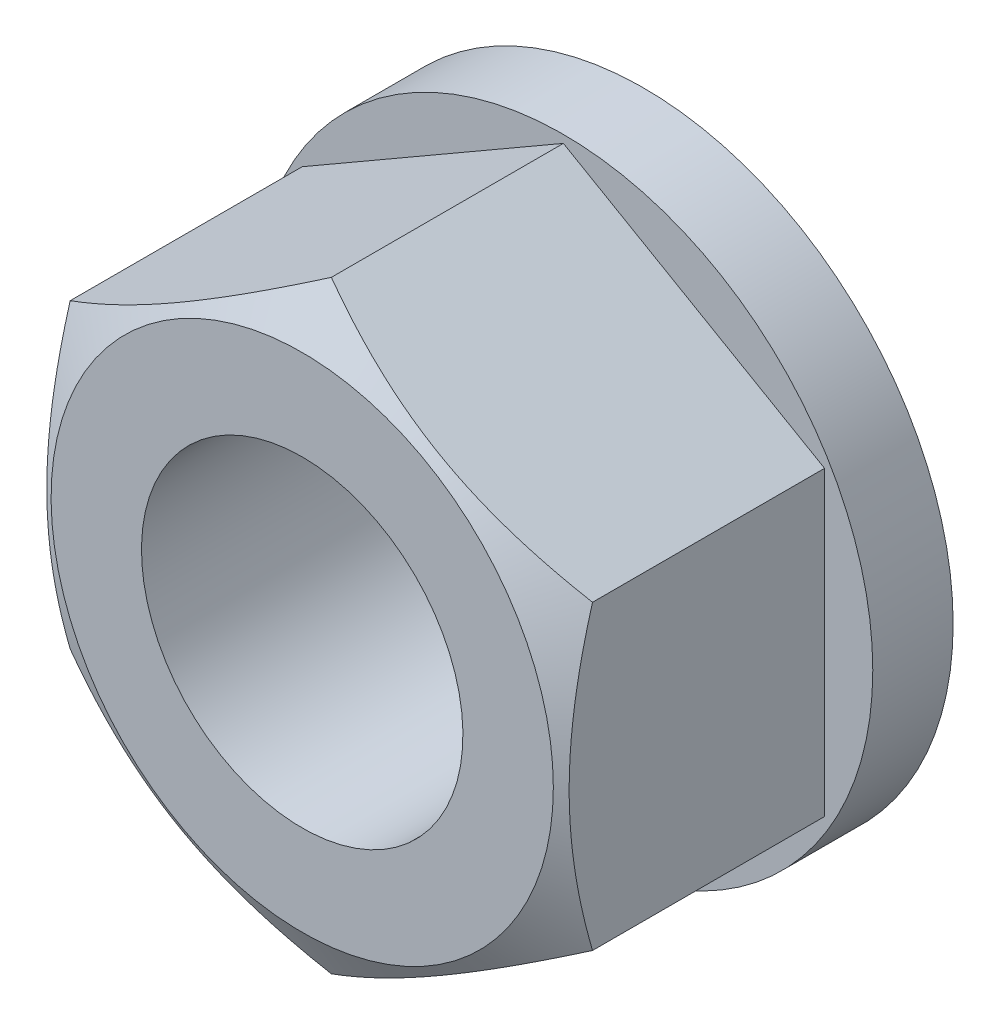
ISO-10303-21;
HEADER;
FILE_DESCRIPTION(('STEP AP214'),'2;1');
FILE_NAME('part.step','',(''),(''),'','','');
FILE_SCHEMA(('AUTOMOTIVE_DESIGN { 1 0 10303 214 1 1 1 1 }'));
ENDSEC;
DATA;
#1=APPLICATION_CONTEXT('core data for automotive mechanical design processes');
#2=APPLICATION_PROTOCOL_DEFINITION('international standard','automotive_design',2000,#1);
#3=PRODUCT_CONTEXT('',#1,'mechanical');
#4=PRODUCT('Part','Part','',(#3));
#5=PRODUCT_RELATED_PRODUCT_CATEGORY('part','',(#4));
#6=PRODUCT_DEFINITION_FORMATION('','',#4);
#7=PRODUCT_DEFINITION_CONTEXT('part definition',#1,'design');
#8=PRODUCT_DEFINITION('design','',#6,#7);
#9=PRODUCT_DEFINITION_SHAPE('','',#8);
#10=(LENGTH_UNIT() NAMED_UNIT(*) SI_UNIT(.MILLI.,.METRE.));
#11=(NAMED_UNIT(*) PLANE_ANGLE_UNIT() SI_UNIT($,.RADIAN.));
#12=(NAMED_UNIT(*) SI_UNIT($,.STERADIAN.) SOLID_ANGLE_UNIT());
#13=UNCERTAINTY_MEASURE_WITH_UNIT(LENGTH_MEASURE(1.E-05),#10,'distance_accuracy_value','');
#14=(GEOMETRIC_REPRESENTATION_CONTEXT(3) GLOBAL_UNCERTAINTY_ASSIGNED_CONTEXT((#13)) GLOBAL_UNIT_ASSIGNED_CONTEXT((#10,
#11,#12)) REPRESENTATION_CONTEXT('',''));
#15=CARTESIAN_POINT('',(0.,0.,0.));
#16=DIRECTION('',(0.,0.,1.));
#17=DIRECTION('',(1.,0.,0.));
#18=AXIS2_PLACEMENT_3D('',#15,#16,#17);
#19=CARTESIAN_POINT('',(6.5,-7.595620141,8.5));
#20=DIRECTION('',(0.,0.,-1.));
#21=DIRECTION('',(-1.,0.,0.));
#22=AXIS2_PLACEMENT_3D('',#19,#20,#21);
#23=PLANE('',#22);
#24=CARTESIAN_POINT('',(0.,0.,8.5));
#25=DIRECTION('',(0.,0.,-1.));
#26=DIRECTION('',(0.,1.,0.));
#27=AXIS2_PLACEMENT_3D('',#24,#25,#26);
#28=CIRCLE('',#27,4.);
#29=CARTESIAN_POINT('',(0.,4.,8.5));
#30=VERTEX_POINT('',#29);
#31=EDGE_CURVE('E86',#30,#30,#28,.T.);
#32=ORIENTED_EDGE('',*,*,#31,.T.);
#33=EDGE_LOOP('',(#32));
#34=FACE_BOUND('',#33,.T.);
#35=CARTESIAN_POINT('',(0.,0.,8.5));
#36=DIRECTION('',(0.,0.,1.));
#37=DIRECTION('',(1.,0.,0.));
#38=AXIS2_PLACEMENT_3D('',#35,#36,#37);
#39=CIRCLE('',#38,6.25);
#40=CARTESIAN_POINT('',(6.25,0.,8.5));
#41=VERTEX_POINT('',#40);
#42=EDGE_CURVE('E219',#41,#41,#39,.T.);
#43=ORIENTED_EDGE('',*,*,#42,.T.);
#44=EDGE_LOOP('',(#43));
#45=FACE_BOUND('',#44,.T.);
#46=ADVANCED_FACE('F14',(#34,#45),#23,.F.);
#47=CARTESIAN_POINT('',(0.,-7.505553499,2.));
#48=DIRECTION('',(0.499999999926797,0.866025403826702,0.));
#49=DIRECTION('',(-0.866025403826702,0.499999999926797,0.));
#50=AXIS2_PLACEMENT_3D('',#47,#48,#49);
#51=PLANE('',#50);
#52=CARTESIAN_POINT('',(-6.5002000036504,-3.75266127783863,7.77503917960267));
#53=CARTESIAN_POINT('',(-6.35732254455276,-3.83515161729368,7.82265800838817));
#54=CARTESIAN_POINT('',(-6.21391236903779,-3.91794952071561,7.86811573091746));
#55=CARTESIAN_POINT('',(-5.92592737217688,-4.08421773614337,7.95411374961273));
#56=CARTESIAN_POINT('',(-5.78135207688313,-4.1676883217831,7.99465192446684));
#57=CARTESIAN_POINT('',(-5.34531135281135,-4.41943655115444,8.10809143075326));
#58=CARTESIAN_POINT('',(-5.05212472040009,-4.58870793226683,8.17261462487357));
#59=CARTESIAN_POINT('',(-4.6133762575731,-4.84201947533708,8.24827584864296));
#60=CARTESIAN_POINT('',(-4.46912536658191,-4.92530276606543,8.26982957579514));
#61=CARTESIAN_POINT('',(-4.17997178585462,-5.09224566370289,8.30597211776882));
#62=CARTESIAN_POINT('',(-4.03506915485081,-5.17590523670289,8.32056154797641));
#63=CARTESIAN_POINT('',(-3.74501222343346,-5.34336968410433,8.34240368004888));
#64=CARTESIAN_POINT('',(-3.59985839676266,-5.42717428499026,8.34966470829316));
#65=CARTESIAN_POINT('',(-3.30942466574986,-5.59485627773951,8.35670213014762));
#66=CARTESIAN_POINT('',(-3.1641447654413,-5.67873366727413,8.35647875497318));
#67=CARTESIAN_POINT('',(-2.76612405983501,-5.90853102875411,8.34557897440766));
#68=CARTESIAN_POINT('',(-2.51351354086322,-6.05437577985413,8.32728061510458));
#69=CARTESIAN_POINT('',(-2.00997032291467,-6.34509659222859,8.26925609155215));
#70=CARTESIAN_POINT('',(-1.75903939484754,-6.48997163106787,8.22951009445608));
#71=CARTESIAN_POINT('',(-1.25448277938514,-6.78127752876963,8.13015652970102));
#72=CARTESIAN_POINT('',(-1.0009207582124,-6.92767162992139,8.07012800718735));
#73=CARTESIAN_POINT('',(-0.497578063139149,-7.21827667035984,7.93388744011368));
#74=CARTESIAN_POINT('',(-0.24779094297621,-7.36249133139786,7.85770739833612));
#75=CARTESIAN_POINT('',(0.000200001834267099,-7.50566897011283,7.77503918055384));
#76=B_SPLINE_CURVE_WITH_KNOTS('',3,(#52,#53,#54,#55,#56,#57,#58,#59,#60,#61,#62,#63,#64,#65,#66,
#67,#68,#69,#70,#71,#72,#73,#74,#75),.UNSPECIFIED.,.F.,.F.,(4,2,2,2,2,2,2,2,2,2,2,4),(0.,
0.515105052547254,1.03043143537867,2.06322554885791,2.56697389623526,3.07067772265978,
3.57380860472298,4.07692394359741,4.95279354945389,5.82947447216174,6.72559912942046,
7.6199645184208),.UNSPECIFIED.);
#77=CARTESIAN_POINT('',(-6.5,-3.75277675,7.77510584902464));
#78=VERTEX_POINT('',#77);
#79=CARTESIAN_POINT('',(0.,-7.505553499,7.77510584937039));
#80=VERTEX_POINT('',#79);
#81=EDGE_CURVE('E100',#78,#80,#76,.T.);
#82=ORIENTED_EDGE('',*,*,#81,.F.);
#83=DIRECTION('',(0.,0.,-1.));
#84=VECTOR('',#83,1.);
#85=CARTESIAN_POINT('',(-6.5,-3.75277675,5.25));
#86=LINE('',#85,#84);
#87=CARTESIAN_POINT('',(-6.5000000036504,-3.75277674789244,2.));
#88=VERTEX_POINT('',#87);
#89=EDGE_CURVE('E70',#78,#88,#86,.T.);
#90=ORIENTED_EDGE('',*,*,#89,.T.);
#91=DIRECTION('',(-0.866025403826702,0.499999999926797,0.));
#92=VECTOR('',#91,1.);
#93=CARTESIAN_POINT('',(0.,-7.505553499,2.));
#94=LINE('',#93,#92);
#95=CARTESIAN_POINT('',(0.,-7.505553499,2.));
#96=VERTEX_POINT('',#95);
#97=EDGE_CURVE('E64',#88,#96,#94,.F.);
#98=ORIENTED_EDGE('',*,*,#97,.T.);
#99=DIRECTION('',(0.,0.,1.));
#100=VECTOR('',#99,1.);
#101=CARTESIAN_POINT('',(0.,-7.505553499,5.25));
#102=LINE('',#101,#100);
#103=EDGE_CURVE('E68',#96,#80,#102,.T.);
#104=ORIENTED_EDGE('',*,*,#103,.T.);
#105=EDGE_LOOP('',(#82,#90,#98,#104));
#106=FACE_BOUND('',#105,.T.);
#107=ADVANCED_FACE('F67',(#106),#51,.F.);
#108=CARTESIAN_POINT('',(6.5,-3.75277675,2.));
#109=DIRECTION('',(-0.499999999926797,0.866025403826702,0.));
#110=DIRECTION('',(-0.866025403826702,-0.499999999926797,0.));
#111=AXIS2_PLACEMENT_3D('',#108,#109,#110);
#112=PLANE('',#111);
#113=CARTESIAN_POINT('',(-0.000199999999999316,-7.50566896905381,7.7750391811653));
#114=CARTESIAN_POINT('',(0.142677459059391,-7.42317862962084,7.82265800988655));
#115=CARTESIAN_POINT('',(0.286087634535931,-7.3403807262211,7.86811573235));
#116=CARTESIAN_POINT('',(0.574072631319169,-7.17411251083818,7.95411375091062));
#117=CARTESIAN_POINT('',(0.718647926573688,-7.09064192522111,7.99465192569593));
#118=CARTESIAN_POINT('',(1.15468865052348,-6.8388936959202,8.10809143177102));
#119=CARTESIAN_POINT('',(1.44787528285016,-6.66962231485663,8.17261462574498));
#120=CARTESIAN_POINT('',(1.88662374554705,-6.4163107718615,8.24827584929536));
#121=CARTESIAN_POINT('',(2.0308746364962,-6.33302748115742,8.26982957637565));
#122=CARTESIAN_POINT('',(2.32002821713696,-6.16608458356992,8.30597211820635));
#123=CARTESIAN_POINT('',(2.46493084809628,-6.0824250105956,8.32056154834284));
#124=CARTESIAN_POINT('',(2.75498777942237,-5.91496056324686,8.34240368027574));
#125=CARTESIAN_POINT('',(2.90014160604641,-5.83115596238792,8.34966470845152));
#126=CARTESIAN_POINT('',(3.19057533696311,-5.66347396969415,8.35670213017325));
#127=CARTESIAN_POINT('',(3.33585523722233,-5.57959658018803,8.35647875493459));
#128=CARTESIAN_POINT('',(3.73387594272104,-5.34979921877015,8.34557897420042));
#129=CARTESIAN_POINT('',(3.98648646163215,-5.20395446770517,8.32728061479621));
#130=CARTESIAN_POINT('',(4.49002967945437,-4.91323365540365,8.26925609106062));
#131=CARTESIAN_POINT('',(4.74096060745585,-4.76835861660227,8.22951009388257));
#132=CARTESIAN_POINT('',(5.24551722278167,-4.47705271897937,8.13015652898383));
#133=CARTESIAN_POINT('',(5.49907924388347,-4.33065861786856,8.07012800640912));
#134=CARTESIAN_POINT('',(6.00242193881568,-4.04005357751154,7.93388743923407));
#135=CARTESIAN_POINT('',(6.25220905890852,-3.89583891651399,7.85770739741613));
#136=CARTESIAN_POINT('',(6.5002000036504,-3.75266127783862,7.77503917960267));
#137=B_SPLINE_CURVE_WITH_KNOTS('',3,(#113,#114,#115,#116,#117,#118,#119,#120,#121,#122,#123,
#124,#125,#126,#127,#128,#129,#130,#131,#132,#133,#134,#135,#136),.UNSPECIFIED.,.F.,.F.,(4,2,2,
2,2,2,2,2,2,2,2,4),(0.,0.515105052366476,1.03043143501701,2.06322554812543,2.56697389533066,
3.07067772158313,3.57380860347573,4.07692394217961,4.95279354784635,5.82947447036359,
6.72559912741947,7.61996451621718),.UNSPECIFIED.);
#138=CARTESIAN_POINT('',(6.5,-3.75277675,7.77510584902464));
#139=VERTEX_POINT('',#138);
#140=EDGE_CURVE('E84',#80,#139,#137,.T.);
#141=ORIENTED_EDGE('',*,*,#140,.F.);
#142=ORIENTED_EDGE('',*,*,#103,.F.);
#143=DIRECTION('',(-0.866025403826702,-0.499999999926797,0.));
#144=VECTOR('',#143,1.);
#145=CARTESIAN_POINT('',(6.5,-3.75277675,2.));
#146=LINE('',#145,#144);
#147=CARTESIAN_POINT('',(6.5000000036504,-3.75277674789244,2.));
#148=VERTEX_POINT('',#147);
#149=EDGE_CURVE('E75',#96,#148,#146,.F.);
#150=ORIENTED_EDGE('',*,*,#149,.T.);
#151=DIRECTION('',(0.,0.,1.));
#152=VECTOR('',#151,1.);
#153=CARTESIAN_POINT('',(6.5,-3.75277675,5.25));
#154=LINE('',#153,#152);
#155=EDGE_CURVE('E85',#148,#139,#154,.T.);
#156=ORIENTED_EDGE('',*,*,#155,.T.);
#157=EDGE_LOOP('',(#141,#142,#150,#156));
#158=FACE_BOUND('',#157,.T.);
#159=ADVANCED_FACE('F80',(#158),#112,.F.);
#160=CARTESIAN_POINT('',(6.5,-3.75277675,2.));
#161=DIRECTION('',(-1.,0.,0.));
#162=DIRECTION('',(0.,0.,1.));
#163=AXIS2_PLACEMENT_3D('',#160,#161,#162);
#164=PLANE('',#163);
#165=CARTESIAN_POINT('',(6.5,-10.0944480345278,5.17667939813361));
#166=CARTESIAN_POINT('',(6.5,-9.81043114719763,5.31450940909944));
#167=CARTESIAN_POINT('',(6.5,-9.5257637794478,5.45102190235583));
#168=CARTESIAN_POINT('',(6.5,-8.95478222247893,5.72067113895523));
#169=CARTESIAN_POINT('',(6.5,-8.66846778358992,5.85380735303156));
#170=CARTESIAN_POINT('',(6.5,-8.09237779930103,6.11663010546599));
#171=CARTESIAN_POINT('',(6.5,-7.80259190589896,6.24629403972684));
#172=CARTESIAN_POINT('',(6.5,-7.22072013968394,6.50033433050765));
#173=CARTESIAN_POINT('',(6.5,-6.92863437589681,6.62471093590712));
#174=CARTESIAN_POINT('',(6.5,-6.33221872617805,6.87069086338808));
#175=CARTESIAN_POINT('',(6.5,-6.02779796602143,6.99207504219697));
#176=CARTESIAN_POINT('',(6.5,-5.41539981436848,7.22569043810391));
#177=CARTESIAN_POINT('',(6.5,-5.10742202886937,7.33792062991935));
#178=CARTESIAN_POINT('',(6.5,-4.4879929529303,7.55029244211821));
#179=CARTESIAN_POINT('',(6.5,-4.17655009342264,7.6504584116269));
#180=CARTESIAN_POINT('',(6.5,-3.54919348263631,7.83549572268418));
#181=CARTESIAN_POINT('',(6.5,-3.2332811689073,7.92037186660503));
#182=CARTESIAN_POINT('',(6.5,-2.59857738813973,8.07031720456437));
#183=CARTESIAN_POINT('',(6.5,-2.27981181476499,8.13549425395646));
#184=CARTESIAN_POINT('',(6.5,-1.63825665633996,8.24235227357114));
#185=CARTESIAN_POINT('',(6.5,-1.31546746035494,8.2840354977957));
#186=CARTESIAN_POINT('',(6.5,-0.831697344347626,8.32617285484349));
#187=CARTESIAN_POINT('',(6.5,-0.671564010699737,8.33681604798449));
#188=CARTESIAN_POINT('',(6.5,-0.350983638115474,8.35132617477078));
#189=CARTESIAN_POINT('',(6.5,-0.190536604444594,8.35519322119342));
#190=CARTESIAN_POINT('',(6.5,0.130375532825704,8.35605127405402));
#191=CARTESIAN_POINT('',(6.5,0.290840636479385,8.35304225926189));
#192=CARTESIAN_POINT('',(6.5,0.611501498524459,8.34022391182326));
#193=CARTESIAN_POINT('',(6.5,0.771697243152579,8.33041424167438));
#194=CARTESIAN_POINT('',(6.5,1.1562660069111,8.29890920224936));
#195=CARTESIAN_POINT('',(6.5,1.3803821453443,8.27401080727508));
#196=CARTESIAN_POINT('',(6.5,1.82694981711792,8.21225787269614));
#197=CARTESIAN_POINT('',(6.5,2.04940112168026,8.1754017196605));
#198=CARTESIAN_POINT('',(6.5,2.71400381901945,8.04885093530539));
#199=CARTESIAN_POINT('',(6.5,3.1531564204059,7.94319694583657));
#200=CARTESIAN_POINT('',(6.5,3.80983188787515,7.75999262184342));
#201=CARTESIAN_POINT('',(6.5,4.03076093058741,7.69394926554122));
#202=CARTESIAN_POINT('',(6.5,4.47047318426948,7.55500512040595));
#203=CARTESIAN_POINT('',(6.5,4.6892563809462,7.48210428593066));
#204=CARTESIAN_POINT('',(6.5,5.12474586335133,7.33061471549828));
#205=CARTESIAN_POINT('',(6.5,5.34145280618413,7.25202785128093));
#206=CARTESIAN_POINT('',(6.5,5.77307124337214,7.09009068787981));
#207=CARTESIAN_POINT('',(6.5,5.98798275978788,7.00674044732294));
#208=CARTESIAN_POINT('',(6.5,6.49928652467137,6.80295702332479));
#209=CARTESIAN_POINT('',(6.5,6.79494350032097,6.68068229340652));
#210=CARTESIAN_POINT('',(6.5,7.3837099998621,6.43012843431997));
#211=CARTESIAN_POINT('',(6.5,7.67681936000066,6.30184892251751));
#212=CARTESIAN_POINT('',(6.5,8.26096561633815,6.04050503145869));
#213=CARTESIAN_POINT('',(6.5,8.55200206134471,5.90743964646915));
#214=CARTESIAN_POINT('',(6.5,9.13230299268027,5.63749273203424));
#215=CARTESIAN_POINT('',(6.5,9.42156743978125,5.50061111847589));
#216=CARTESIAN_POINT('',(6.5,9.99892998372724,5.22360602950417));
#217=CARTESIAN_POINT('',(6.5,10.2870264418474,5.08347914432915));
#218=CARTESIAN_POINT('',(6.5,10.8619710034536,4.80068497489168));
#219=CARTESIAN_POINT('',(6.5,11.1488190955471,4.65801766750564));
#220=CARTESIAN_POINT('',(6.5,12.0077127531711,4.22692717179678));
#221=CARTESIAN_POINT('',(6.5,12.5781883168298,3.93537640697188));
#222=CARTESIAN_POINT('',(6.5,13.667591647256,3.37154002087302));
#223=CARTESIAN_POINT('',(6.5,14.1867673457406,3.09973127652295));
#224=CARTESIAN_POINT('',(6.5,15.2231972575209,2.55243129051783));
#225=CARTESIAN_POINT('',(6.5,15.7404513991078,2.27693991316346));
#226=CARTESIAN_POINT('',(6.5,16.7721419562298,1.72386624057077));
#227=CARTESIAN_POINT('',(6.5,17.2865821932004,1.4462910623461));
#228=CARTESIAN_POINT('',(6.5,18.3142367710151,0.888948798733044));
#229=CARTESIAN_POINT('',(6.5,18.827451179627,0.609181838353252));
#230=CARTESIAN_POINT('',(6.5,19.3402157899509,0.328598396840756));
#231=B_SPLINE_CURVE_WITH_KNOTS('',3,(#165,#166,#167,#168,#169,#170,#171,#172,#173,#174,#175,
#176,#177,#178,#179,#180,#181,#182,#183,#184,#185,#186,#187,#188,#189,#190,#191,#192,#193,#194,
#195,#196,#197,#198,#199,#200,#201,#202,#203,#204,#205,#206,#207,#208,#209,#210,#211,#212,#213,
#214,#215,#216,#217,#218,#219,#220,#221,#222,#223,#224,#225,#226,#227,#228,#229,#230),
.UNSPECIFIED.,.F.,.F.,(4,2,2,2,2,2,2,2,2,2,2,2,2,2,2,2,2,2,2,2,2,2,2,2,2,2,2,2,2,2,2,2,4),(0.,
0.947093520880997,1.89433460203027,2.84670891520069,3.79903834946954,4.78211086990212,
5.76529334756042,6.74645698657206,7.72731191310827,8.70269495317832,9.6779843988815,
10.1593227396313,10.6406530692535,11.1219848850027,11.6033405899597,12.2794438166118,
12.9556383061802,14.3087698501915,15.0004795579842,15.6921938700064,16.383681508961,
17.0751606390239,18.0349025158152,18.9947056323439,19.9547116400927,20.9147388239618,
21.8758250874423,22.836920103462,24.7588414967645,26.516895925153,28.2750153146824,
30.0286546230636,31.7821946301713),.UNSPECIFIED.);
#232=CARTESIAN_POINT('',(6.5,3.75277675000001,7.77510584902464));
#233=VERTEX_POINT('',#232);
#234=EDGE_CURVE('E105',#139,#233,#231,.T.);
#235=ORIENTED_EDGE('',*,*,#234,.F.);
#236=ORIENTED_EDGE('',*,*,#155,.F.);
#237=DIRECTION('',(0.,1.,0.));
#238=VECTOR('',#237,1.);
#239=CARTESIAN_POINT('',(6.5000000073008,0.,2.));
#240=LINE('',#239,#238);
#241=CARTESIAN_POINT('',(6.5000000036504,3.75277674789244,2.));
#242=VERTEX_POINT('',#241);
#243=EDGE_CURVE('E91',#148,#242,#240,.T.);
#244=ORIENTED_EDGE('',*,*,#243,.T.);
#245=DIRECTION('',(0.,0.,1.));
#246=VECTOR('',#245,1.);
#247=CARTESIAN_POINT('',(6.5,3.75277675,5.25));
#248=LINE('',#247,#246);
#249=EDGE_CURVE('E210',#242,#233,#248,.T.);
#250=ORIENTED_EDGE('',*,*,#249,.T.);
#251=EDGE_LOOP('',(#235,#236,#244,#250));
#252=FACE_BOUND('',#251,.T.);
#253=ADVANCED_FACE('F156',(#252),#164,.F.);
#254=CARTESIAN_POINT('',(0.,7.505553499,2.));
#255=DIRECTION('',(-0.499999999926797,-0.866025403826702,0.));
#256=DIRECTION('',(0.866025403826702,-0.499999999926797,0.));
#257=AXIS2_PLACEMENT_3D('',#254,#255,#256);
#258=PLANE('',#257);
#259=CARTESIAN_POINT('',(6.5002000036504,3.75266127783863,7.77503917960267));
#260=CARTESIAN_POINT('',(6.35732254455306,3.83515161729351,7.82265800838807));
#261=CARTESIAN_POINT('',(6.21391236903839,3.91794952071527,7.86811573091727));
#262=CARTESIAN_POINT('',(5.92592737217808,4.08421773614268,7.95411374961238));
#263=CARTESIAN_POINT('',(5.78135207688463,4.16768832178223,7.99465192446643));
#264=CARTESIAN_POINT('',(5.34531135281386,4.41943655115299,8.10809143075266));
#265=CARTESIAN_POINT('',(5.05212472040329,4.58870793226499,8.1726146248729));
#266=CARTESIAN_POINT('',(4.61337625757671,4.842019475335,8.2482758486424));
#267=CARTESIAN_POINT('',(4.46912536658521,4.92530276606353,8.26982957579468));
#268=CARTESIAN_POINT('',(4.1799717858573,5.09224566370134,8.30597211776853));
#269=CARTESIAN_POINT('',(4.03506915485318,5.17590523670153,8.32056154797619));
#270=CARTESIAN_POINT('',(3.74501222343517,5.34336968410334,8.34240368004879));
#271=CARTESIAN_POINT('',(3.59985839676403,5.42717428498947,8.34966470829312));
#272=CARTESIAN_POINT('',(3.30942466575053,5.59485627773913,8.35670213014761));
#273=CARTESIAN_POINT('',(3.16414476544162,5.67873366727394,8.35647875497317));
#274=CARTESIAN_POINT('',(2.76612405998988,5.90853102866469,8.34557897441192));
#275=CARTESIAN_POINT('',(2.51351354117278,6.05437577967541,8.32728061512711));
#276=CARTESIAN_POINT('',(2.00997032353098,6.34509659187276,8.26925609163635));
#277=CARTESIAN_POINT('',(1.75903939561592,6.48997163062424,8.22951009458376));
#278=CARTESIAN_POINT('',(1.25448278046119,6.78127752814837,8.13015652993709));
#279=CARTESIAN_POINT('',(1.0009207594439,6.92767162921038,8.07012800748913));
#280=CARTESIAN_POINT('',(0.497578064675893,7.2182766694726,7.93388744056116));
#281=CARTESIAN_POINT('',(0.247790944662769,7.36249133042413,7.85770739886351));
#282=CARTESIAN_POINT('',(-0.000200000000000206,7.50566896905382,7.77503918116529));
#283=B_SPLINE_CURVE_WITH_KNOTS('',3,(#259,#260,#261,#262,#263,#264,#265,#266,#267,#268,#269,
#270,#271,#272,#273,#274,#275,#276,#277,#278,#279,#280,#281,#282),.UNSPECIFIED.,.F.,.F.,(4,2,2,
2,2,2,2,2,2,2,2,4),(0.,0.515105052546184,1.03043143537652,2.06322554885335,2.56697389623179,
3.0706777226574,3.57380860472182,4.07692394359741,4.9527935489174,5.82947447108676,
6.72559912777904,7.61996451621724),.UNSPECIFIED.);
#284=CARTESIAN_POINT('',(0.,7.505553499,7.77510584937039));
#285=VERTEX_POINT('',#284);
#286=EDGE_CURVE('E144',#233,#285,#283,.T.);
#287=ORIENTED_EDGE('',*,*,#286,.F.);
#288=ORIENTED_EDGE('',*,*,#249,.F.);
#289=DIRECTION('',(0.866025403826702,-0.499999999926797,0.));
#290=VECTOR('',#289,1.);
#291=CARTESIAN_POINT('',(0.,7.505553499,2.));
#292=LINE('',#291,#290);
#293=CARTESIAN_POINT('',(0.,7.505553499,2.));
#294=VERTEX_POINT('',#293);
#295=EDGE_CURVE('E93',#242,#294,#292,.F.);
#296=ORIENTED_EDGE('',*,*,#295,.T.);
#297=DIRECTION('',(0.,0.,1.));
#298=VECTOR('',#297,1.);
#299=CARTESIAN_POINT('',(0.,7.505553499,5.25));
#300=LINE('',#299,#298);
#301=EDGE_CURVE('E119',#294,#285,#300,.T.);
#302=ORIENTED_EDGE('',*,*,#301,.T.);
#303=EDGE_LOOP('',(#287,#288,#296,#302));
#304=FACE_BOUND('',#303,.T.);
#305=ADVANCED_FACE('F159',(#304),#258,.F.);
#306=CARTESIAN_POINT('',(-6.5,3.75277675,2.));
#307=DIRECTION('',(0.499999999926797,-0.866025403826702,0.));
#308=DIRECTION('',(0.866025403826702,0.499999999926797,0.));
#309=AXIS2_PLACEMENT_3D('',#306,#307,#308);
#310=PLANE('',#309);
#311=CARTESIAN_POINT('',(0.000200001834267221,7.50566897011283,7.77503918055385));
#312=CARTESIAN_POINT('',(-0.14267745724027,7.42317863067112,7.8226580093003));
#313=CARTESIAN_POINT('',(-0.28608763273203,7.34038072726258,7.86811573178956));
#314=CARTESIAN_POINT('',(-0.574072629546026,7.1741125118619,7.95411375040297));
#315=CARTESIAN_POINT('',(-0.718647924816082,7.09064192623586,7.99465192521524));
#316=CARTESIAN_POINT('',(-1.15468864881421,6.83889369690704,8.10809143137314));
#317=CARTESIAN_POINT('',(-1.44787528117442,6.66962231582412,8.17261462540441));
#318=CARTESIAN_POINT('',(-1.88662374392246,6.41631077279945,8.24827584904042));
#319=CARTESIAN_POINT('',(-2.03087463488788,6.33302748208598,8.26982957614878));
#320=CARTESIAN_POINT('',(-2.32002821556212,6.16608458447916,8.30597211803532));
#321=CARTESIAN_POINT('',(-2.46493084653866,6.0824250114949,8.32056154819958));
#322=CARTESIAN_POINT('',(-2.75498777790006,5.91496056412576,8.34240368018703));
#323=CARTESIAN_POINT('',(-2.90014160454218,5.83115596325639,8.34966470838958));
#324=CARTESIAN_POINT('',(-3.19057533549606,5.66347397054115,8.35670213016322));
#325=CARTESIAN_POINT('',(-3.33585523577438,5.579596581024,8.35647875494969));
#326=CARTESIAN_POINT('',(-3.73387594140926,5.34979921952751,8.34557897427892));
#327=CARTESIAN_POINT('',(-3.98648646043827,5.20395446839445,8.32728061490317));
#328=CARTESIAN_POINT('',(-4.49002967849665,4.91323365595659,8.2692560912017));
#329=CARTESIAN_POINT('',(-4.74096060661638,4.76835861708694,8.22951009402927));
#330=CARTESIAN_POINT('',(-5.24551722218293,4.47705271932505,8.13015652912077));
#331=CARTESIAN_POINT('',(-5.49907924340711,4.33065861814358,8.07012800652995));
#332=CARTESIAN_POINT('',(-6.00242193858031,4.04005357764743,7.93388743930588));
#333=CARTESIAN_POINT('',(-6.25220905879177,3.8958389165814,7.8577073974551));
#334=CARTESIAN_POINT('',(-6.5002000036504,3.75266127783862,7.77503917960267));
#335=B_SPLINE_CURVE_WITH_KNOTS('',3,(#311,#312,#313,#314,#315,#316,#317,#318,#319,#320,#321,
#322,#323,#324,#325,#326,#327,#328,#329,#330,#331,#332,#333,#334),.UNSPECIFIED.,.F.,.F.,(4,2,2,
2,2,2,2,2,2,2,2,4),(0.,0.515105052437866,1.03043143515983,2.06322554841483,2.56697389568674,
3.07067772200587,3.57380860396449,4.07692394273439,4.95279354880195,5.82947447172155,
6.7255991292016,7.61996451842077),.UNSPECIFIED.);
#336=CARTESIAN_POINT('',(-6.5,3.75277675,7.77510584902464));
#337=VERTEX_POINT('',#336);
#338=EDGE_CURVE('E34',#285,#337,#335,.T.);
#339=ORIENTED_EDGE('',*,*,#338,.F.);
#340=ORIENTED_EDGE('',*,*,#301,.F.);
#341=DIRECTION('',(0.866025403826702,0.499999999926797,0.));
#342=VECTOR('',#341,1.);
#343=CARTESIAN_POINT('',(-6.5,3.75277675,2.));
#344=LINE('',#343,#342);
#345=CARTESIAN_POINT('',(-6.5000000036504,3.75277674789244,2.));
#346=VERTEX_POINT('',#345);
#347=EDGE_CURVE('E43',#294,#346,#344,.F.);
#348=ORIENTED_EDGE('',*,*,#347,.T.);
#349=DIRECTION('',(0.,0.,1.));
#350=VECTOR('',#349,1.);
#351=CARTESIAN_POINT('',(-6.5,3.75277675,5.25));
#352=LINE('',#351,#350);
#353=EDGE_CURVE('E211',#346,#337,#352,.T.);
#354=ORIENTED_EDGE('',*,*,#353,.T.);
#355=EDGE_LOOP('',(#339,#340,#348,#354));
#356=FACE_BOUND('',#355,.T.);
#357=ADVANCED_FACE('F164',(#356),#310,.F.);
#358=CARTESIAN_POINT('',(-6.5,-3.75277675,8.5));
#359=DIRECTION('',(1.,0.,0.));
#360=DIRECTION('',(0.,0.,-1.));
#361=AXIS2_PLACEMENT_3D('',#358,#359,#360);
#362=PLANE('',#361);
#363=CARTESIAN_POINT('',(-6.5,-10.0944480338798,5.17667939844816));
#364=CARTESIAN_POINT('',(-6.5,-9.81043114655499,5.31450940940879));
#365=CARTESIAN_POINT('',(-6.5,-9.52576377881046,5.45102190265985));
#366=CARTESIAN_POINT('',(-6.5,-8.95478222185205,5.7206711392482));
#367=CARTESIAN_POINT('',(-6.5,-8.6684677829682,5.85380735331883));
#368=CARTESIAN_POINT('',(-6.5,-8.09237779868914,6.1166301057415));
#369=CARTESIAN_POINT('',(-6.5,-7.80259190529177,6.2462940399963));
#370=CARTESIAN_POINT('',(-6.5,-7.22072013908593,6.50033433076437));
#371=CARTESIAN_POINT('',(-6.5,-6.92863437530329,6.62471093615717));
#372=CARTESIAN_POINT('',(-6.5,-6.33221872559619,6.87069086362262));
#373=CARTESIAN_POINT('',(-6.5,-6.02779796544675,6.99207504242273));
#374=CARTESIAN_POINT('',(-6.5,-5.41539981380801,7.22569043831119));
#375=CARTESIAN_POINT('',(-6.5,-5.10742202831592,7.33792063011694));
#376=CARTESIAN_POINT('',(-6.5,-4.48799295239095,7.5502924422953));
#377=CARTESIAN_POINT('',(-6.5,-4.17655009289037,7.65045841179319));
#378=CARTESIAN_POINT('',(-6.5,-3.5491934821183,7.83549572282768));
#379=CARTESIAN_POINT('',(-6.5,-3.23328116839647,7.92037186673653));
#380=CARTESIAN_POINT('',(-6.5,-2.59857738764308,8.07031720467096));
#381=CARTESIAN_POINT('',(-6.5,-2.27981181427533,8.1354942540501));
#382=CARTESIAN_POINT('',(-6.5,-1.63825665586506,8.2423522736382));
#383=CARTESIAN_POINT('',(-6.5,-1.31546745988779,8.28403549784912));
#384=CARTESIAN_POINT('',(-6.5,-0.831697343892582,8.32617285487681));
#385=CARTESIAN_POINT('',(-6.5,-0.67156401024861,8.33681604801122));
#386=CARTESIAN_POINT('',(-6.5,-0.350983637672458,8.35132617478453));
#387=CARTESIAN_POINT('',(-6.5,-0.190536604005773,8.35519322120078));
#388=CARTESIAN_POINT('',(-6.5,0.130375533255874,8.35605127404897));
#389=CARTESIAN_POINT('',(-6.5,0.290840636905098,8.35304225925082));
#390=CARTESIAN_POINT('',(-6.5,0.611501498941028,8.34022391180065));
#391=CARTESIAN_POINT('',(-6.5,0.77169724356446,8.33041424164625));
#392=CARTESIAN_POINT('',(-6.5,1.15626600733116,8.29890920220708));
#393=CARTESIAN_POINT('',(-6.5,1.38038214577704,8.27401080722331));
#394=CARTESIAN_POINT('',(-6.5,1.8269498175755,8.21225787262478));
#395=CARTESIAN_POINT('',(-6.5,2.04940112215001,8.17540171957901));
#396=CARTESIAN_POINT('',(-6.5,2.71400381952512,8.04885093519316));
#397=CARTESIAN_POINT('',(-6.5,3.15315642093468,7.94319694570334));
#398=CARTESIAN_POINT('',(-6.5,3.80983188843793,7.7599926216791));
#399=CARTESIAN_POINT('',(-6.5,4.0307609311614,7.69394926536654));
#400=CARTESIAN_POINT('',(-6.5,4.47047318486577,7.55500512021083));
#401=CARTESIAN_POINT('',(-6.5,4.68925638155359,7.48210428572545));
#402=CARTESIAN_POINT('',(-6.5,5.1247458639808,7.33061471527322));
#403=CARTESIAN_POINT('',(-6.5,5.3414528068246,7.25202785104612));
#404=CARTESIAN_POINT('',(-6.5,5.77307124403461,7.09009068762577));
#405=CARTESIAN_POINT('',(-6.5,5.98798276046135,7.00674044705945));
#406=CARTESIAN_POINT('',(-6.5,6.49928652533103,6.80295702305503));
#407=CARTESIAN_POINT('',(-6.5,6.79494350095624,6.68068229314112));
#408=CARTESIAN_POINT('',(-6.5,7.38371000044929,6.43012843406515));
#409=CARTESIAN_POINT('',(-6.5,7.67681936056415,6.30184892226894));
#410=CARTESIAN_POINT('',(-6.5,8.26096561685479,6.04050503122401));
#411=CARTESIAN_POINT('',(-6.5,8.55200206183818,5.90743964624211));
#412=CARTESIAN_POINT('',(-6.5,9.13230299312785,5.63749273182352));
#413=CARTESIAN_POINT('',(-6.5,9.4215674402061,5.50061111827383));
#414=CARTESIAN_POINT('',(-6.5,9.99892998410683,5.22360602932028));
#415=CARTESIAN_POINT('',(-6.5,10.2870264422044,5.08347914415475));
#416=CARTESIAN_POINT('',(-6.5,10.8619710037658,4.80068497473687));
#417=CARTESIAN_POINT('',(-6.5,11.1488190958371,4.65801766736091));
#418=CARTESIAN_POINT('',(-6.5,12.0077127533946,4.22692717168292));
#419=CARTESIAN_POINT('',(-6.5,12.5781883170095,3.93537640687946));
#420=CARTESIAN_POINT('',(-6.5,13.6675916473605,3.37154002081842));
#421=CARTESIAN_POINT('',(-6.5,14.1867673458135,3.09973127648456));
#422=CARTESIAN_POINT('',(-6.5,15.223197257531,2.55243129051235));
#423=CARTESIAN_POINT('',(-6.5,15.7404513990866,2.27693991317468));
#424=CARTESIAN_POINT('',(-6.5,16.7721419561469,1.72386624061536));
#425=CARTESIAN_POINT('',(-6.5,17.286582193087,1.44629106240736));
#426=CARTESIAN_POINT('',(-6.5,18.3142367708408,0.888948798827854));
#427=CARTESIAN_POINT('',(-6.5,18.8274511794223,0.609181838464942));
#428=CARTESIAN_POINT('',(-6.5,19.3402157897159,0.328598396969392));
#429=B_SPLINE_CURVE_WITH_KNOTS('',3,(#363,#364,#365,#366,#367,#368,#369,#370,#371,#372,#373,
#374,#375,#376,#377,#378,#379,#380,#381,#382,#383,#384,#385,#386,#387,#388,#389,#390,#391,#392,
#393,#394,#395,#396,#397,#398,#399,#400,#401,#402,#403,#404,#405,#406,#407,#408,#409,#410,#411,
#412,#413,#414,#415,#416,#417,#418,#419,#420,#421,#422,#423,#424,#425,#426,#427,#428),
.UNSPECIFIED.,.F.,.F.,(4,2,2,2,2,2,2,2,2,2,2,2,2,2,2,2,2,2,2,2,2,2,2,2,2,2,2,2,2,2,2,2,4),(0.,
0.947093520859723,1.89433460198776,2.8467089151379,3.79903834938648,4.78211086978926,
5.76529334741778,6.74645698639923,7.72731191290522,8.70269495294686,9.67798439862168,
10.1593227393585,10.6406530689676,11.1219848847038,11.6033405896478,12.2794438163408,
12.9556383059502,14.3087698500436,15.0004795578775,15.6921938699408,16.3836815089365,
17.0751606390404,18.0349025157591,18.9947056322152,19.9547116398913,20.9147388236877,
21.875825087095,22.8369201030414,24.7588414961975,26.5168959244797,28.2750153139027,
30.0286546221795,31.782194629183),.UNSPECIFIED.);
#430=EDGE_CURVE('E9',#337,#78,#429,.F.);
#431=ORIENTED_EDGE('',*,*,#430,.F.);
#432=ORIENTED_EDGE('',*,*,#353,.F.);
#433=DIRECTION('',(0.,-1.,0.));
#434=VECTOR('',#433,1.);
#435=CARTESIAN_POINT('',(-6.5000000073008,0.,2.));
#436=LINE('',#435,#434);
#437=EDGE_CURVE('E200',#346,#88,#436,.T.);
#438=ORIENTED_EDGE('',*,*,#437,.T.);
#439=ORIENTED_EDGE('',*,*,#89,.F.);
#440=EDGE_LOOP('',(#431,#432,#438,#439));
#441=FACE_BOUND('',#440,.T.);
#442=ADVANCED_FACE('F168',(#441),#362,.F.);
#443=CARTESIAN_POINT('',(0.,0.,8.5));
#444=DIRECTION('',(0.,0.,-1.));
#445=DIRECTION('',(0.,1.,0.));
#446=AXIS2_PLACEMENT_3D('',#443,#444,#445);
#447=CYLINDRICAL_SURFACE('',#446,4.);
#448=CARTESIAN_POINT('',(0.,0.,0.));
#449=DIRECTION('',(0.,0.,-1.));
#450=DIRECTION('',(0.,1.,0.));
#451=AXIS2_PLACEMENT_3D('',#448,#449,#450);
#452=CIRCLE('',#451,4.);
#453=CARTESIAN_POINT('',(0.,4.,0.));
#454=VERTEX_POINT('',#453);
#455=EDGE_CURVE('E76',#454,#454,#452,.F.);
#456=ORIENTED_EDGE('',*,*,#455,.F.);
#457=EDGE_LOOP('',(#456));
#458=FACE_BOUND('',#457,.T.);
#459=ORIENTED_EDGE('',*,*,#31,.F.);
#460=EDGE_LOOP('',(#459));
#461=FACE_BOUND('',#460,.T.);
#462=ADVANCED_FACE('F129',(#458,#461),#447,.F.);
#463=CARTESIAN_POINT('',(7.7924,-7.81921341,0.));
#464=DIRECTION('',(0.,0.,-1.));
#465=DIRECTION('',(-1.,0.,0.));
#466=AXIS2_PLACEMENT_3D('',#463,#464,#465);
#467=PLANE('',#466);
#468=ORIENTED_EDGE('',*,*,#455,.T.);
#469=EDGE_LOOP('',(#468));
#470=FACE_BOUND('',#469,.T.);
#471=CARTESIAN_POINT('',(0.,0.,0.));
#472=DIRECTION('',(0.,0.,1.));
#473=DIRECTION('',(1.,0.,0.));
#474=AXIS2_PLACEMENT_3D('',#471,#472,#473);
#475=CIRCLE('',#474,7.7);
#476=CARTESIAN_POINT('',(7.7,0.,0.));
#477=VERTEX_POINT('',#476);
#478=EDGE_CURVE('E199',#477,#477,#475,.T.);
#479=ORIENTED_EDGE('',*,*,#478,.F.);
#480=EDGE_LOOP('',(#479));
#481=FACE_BOUND('',#480,.T.);
#482=ADVANCED_FACE('F172',(#470,#481),#467,.T.);
#483=CARTESIAN_POINT('',(7.7924,-7.81921341,2.));
#484=DIRECTION('',(0.,0.,-1.));
#485=DIRECTION('',(-1.,0.,0.));
#486=AXIS2_PLACEMENT_3D('',#483,#484,#485);
#487=PLANE('',#486);
#488=ORIENTED_EDGE('',*,*,#347,.F.);
#489=ORIENTED_EDGE('',*,*,#295,.F.);
#490=ORIENTED_EDGE('',*,*,#243,.F.);
#491=ORIENTED_EDGE('',*,*,#149,.F.);
#492=ORIENTED_EDGE('',*,*,#97,.F.);
#493=ORIENTED_EDGE('',*,*,#437,.F.);
#494=EDGE_LOOP('',(#488,#489,#490,#491,#492,#493));
#495=FACE_BOUND('',#494,.T.);
#496=CARTESIAN_POINT('',(0.,0.,2.));
#497=DIRECTION('',(0.,0.,1.));
#498=DIRECTION('',(1.,0.,0.));
#499=AXIS2_PLACEMENT_3D('',#496,#497,#498);
#500=CIRCLE('',#499,7.7);
#501=CARTESIAN_POINT('',(7.7,0.,2.));
#502=VERTEX_POINT('',#501);
#503=EDGE_CURVE('E28',#502,#502,#500,.F.);
#504=ORIENTED_EDGE('',*,*,#503,.F.);
#505=EDGE_LOOP('',(#504));
#506=FACE_BOUND('',#505,.T.);
#507=ADVANCED_FACE('F16',(#495,#506),#487,.F.);
#508=CARTESIAN_POINT('',(0.,0.,0.));
#509=DIRECTION('',(0.,0.,1.));
#510=DIRECTION('',(1.,0.,0.));
#511=AXIS2_PLACEMENT_3D('',#508,#509,#510);
#512=CYLINDRICAL_SURFACE('',#511,7.7);
#513=ORIENTED_EDGE('',*,*,#503,.T.);
#514=EDGE_LOOP('',(#513));
#515=FACE_BOUND('',#514,.T.);
#516=ORIENTED_EDGE('',*,*,#478,.T.);
#517=EDGE_LOOP('',(#516));
#518=FACE_BOUND('',#517,.T.);
#519=ADVANCED_FACE('F127',(#515,#518),#512,.T.);
#520=CARTESIAN_POINT('',(0.,0.,8.5));
#521=DIRECTION('',(0.,0.,-1.));
#522=DIRECTION('',(-1.,0.,0.));
#523=AXIS2_PLACEMENT_3D('',#520,#521,#522);
#524=CONICAL_SURFACE('',#523,6.25,1.0471975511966);
#525=ORIENTED_EDGE('',*,*,#42,.F.);
#526=EDGE_LOOP('',(#525));
#527=FACE_BOUND('',#526,.T.);
#528=ORIENTED_EDGE('',*,*,#81,.T.);
#529=ORIENTED_EDGE('',*,*,#140,.T.);
#530=ORIENTED_EDGE('',*,*,#234,.T.);
#531=ORIENTED_EDGE('',*,*,#286,.T.);
#532=ORIENTED_EDGE('',*,*,#338,.T.);
#533=ORIENTED_EDGE('',*,*,#430,.T.);
#534=EDGE_LOOP('',(#528,#529,#530,#531,#532,#533));
#535=FACE_BOUND('',#534,.T.);
#536=ADVANCED_FACE('F123',(#527,#535),#524,.T.);
#537=CLOSED_SHELL('',(#46,#107,#159,#253,#305,#357,#442,#462,#482,#507,#519,#536));
#538=MANIFOLD_SOLID_BREP('B1',#537);
#539=ADVANCED_BREP_SHAPE_REPRESENTATION('',(#18,#538),#14);
#540=SHAPE_DEFINITION_REPRESENTATION(#9,#539);
ENDSEC;
END-ISO-10303-21;
